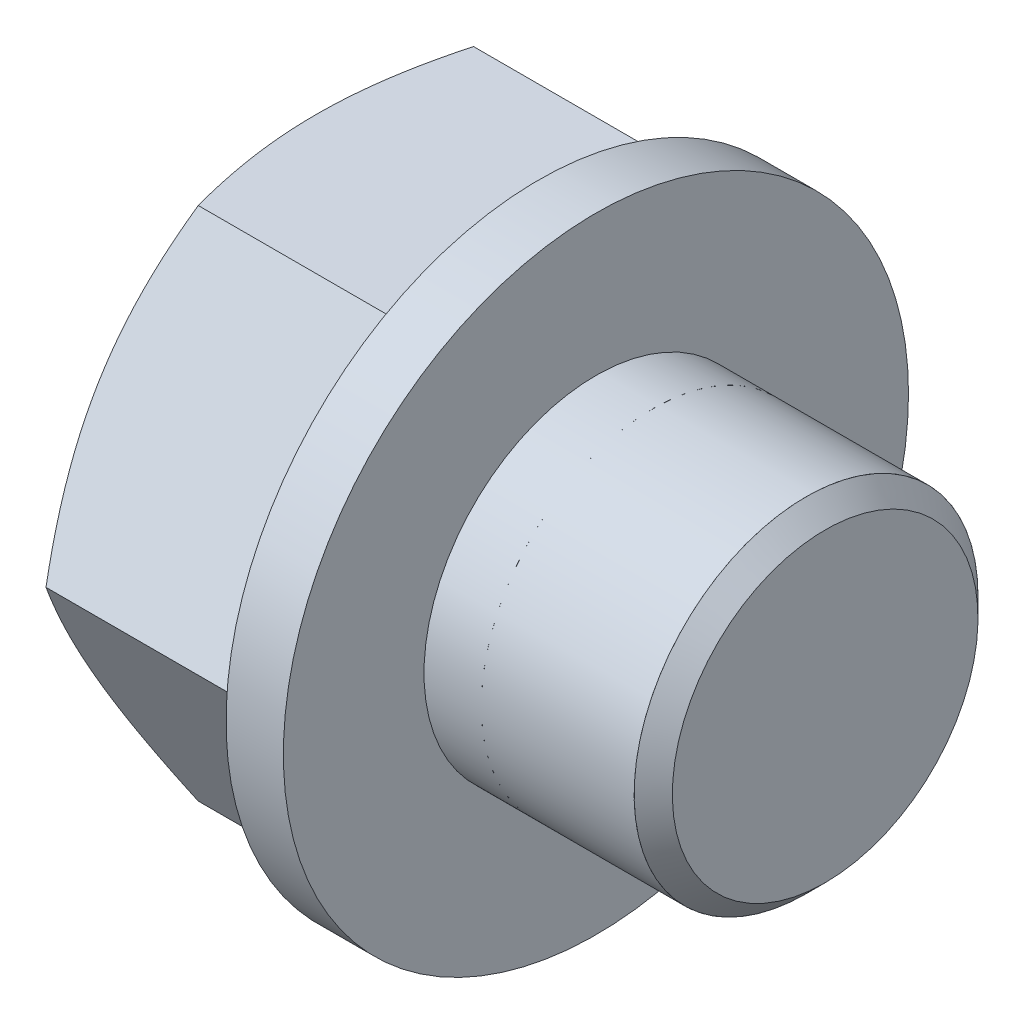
ISO-10303-21;
HEADER;
FILE_DESCRIPTION(('STEP AP214'),'2;1');
FILE_NAME('part.step','',(''),(''),'','','');
FILE_SCHEMA(('AUTOMOTIVE_DESIGN { 1 0 10303 214 1 1 1 1 }'));
ENDSEC;
DATA;
#1=APPLICATION_CONTEXT('core data for automotive mechanical design processes');
#2=APPLICATION_PROTOCOL_DEFINITION('international standard','automotive_design',2000,#1);
#3=PRODUCT_CONTEXT('',#1,'mechanical');
#4=PRODUCT('Part','Part','',(#3));
#5=PRODUCT_RELATED_PRODUCT_CATEGORY('part','',(#4));
#6=PRODUCT_DEFINITION_FORMATION('','',#4);
#7=PRODUCT_DEFINITION_CONTEXT('part definition',#1,'design');
#8=PRODUCT_DEFINITION('design','',#6,#7);
#9=PRODUCT_DEFINITION_SHAPE('','',#8);
#10=(LENGTH_UNIT() NAMED_UNIT(*) SI_UNIT(.MILLI.,.METRE.));
#11=(NAMED_UNIT(*) PLANE_ANGLE_UNIT() SI_UNIT($,.RADIAN.));
#12=(NAMED_UNIT(*) SI_UNIT($,.STERADIAN.) SOLID_ANGLE_UNIT());
#13=UNCERTAINTY_MEASURE_WITH_UNIT(LENGTH_MEASURE(1.E-05),#10,'distance_accuracy_value','');
#14=(GEOMETRIC_REPRESENTATION_CONTEXT(3) GLOBAL_UNCERTAINTY_ASSIGNED_CONTEXT((#13)) GLOBAL_UNIT_ASSIGNED_CONTEXT((#10,
#11,#12)) REPRESENTATION_CONTEXT('',''));
#15=CARTESIAN_POINT('',(0.,0.,0.));
#16=DIRECTION('',(0.,0.,1.));
#17=DIRECTION('',(1.,0.,0.));
#18=AXIS2_PLACEMENT_3D('',#15,#16,#17);
#19=CARTESIAN_POINT('',(14.,0.,0.));
#20=DIRECTION('',(-1.,0.,0.));
#21=DIRECTION('',(0.,0.,1.));
#22=AXIS2_PLACEMENT_3D('',#19,#20,#21);
#23=CYLINDRICAL_SURFACE('',#22,8.);
#24=CARTESIAN_POINT('',(6.,0.,0.));
#25=DIRECTION('',(-1.,0.,0.));
#26=DIRECTION('',(0.,0.,1.));
#27=AXIS2_PLACEMENT_3D('',#24,#25,#26);
#28=CIRCLE('',#27,8.);
#29=CARTESIAN_POINT('',(6.,0.,8.));
#30=VERTEX_POINT('',#29);
#31=EDGE_CURVE('P0_E20',#30,#30,#28,.F.);
#32=ORIENTED_EDGE('',*,*,#31,.T.);
#33=EDGE_LOOP('',(#32));
#34=FACE_BOUND('',#33,.T.);
#35=CARTESIAN_POINT('',(14.,0.,0.));
#36=DIRECTION('',(-1.,0.,0.));
#37=DIRECTION('',(0.,0.,1.));
#38=AXIS2_PLACEMENT_3D('',#35,#36,#37);
#39=CIRCLE('',#38,8.);
#40=CARTESIAN_POINT('',(14.,0.,8.));
#41=VERTEX_POINT('',#40);
#42=EDGE_CURVE('P0_E11',#41,#41,#39,.T.);
#43=ORIENTED_EDGE('',*,*,#42,.T.);
#44=EDGE_LOOP('',(#43));
#45=FACE_BOUND('',#44,.T.);
#46=ADVANCED_FACE('P0_F16',(#34,#45),#23,.T.);
#47=CARTESIAN_POINT('',(14.,0.,0.));
#48=DIRECTION('',(1.,0.,0.));
#49=DIRECTION('',(0.,0.,-1.));
#50=AXIS2_PLACEMENT_3D('',#47,#48,#49);
#51=PLANE('',#50);
#52=ORIENTED_EDGE('',*,*,#42,.F.);
#53=EDGE_LOOP('',(#52));
#54=FACE_BOUND('',#53,.T.);
#55=CARTESIAN_POINT('',(14.,9.,0.));
#56=CARTESIAN_POINT('',(14.,8.99990265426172,0.825985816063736));
#57=CARTESIAN_POINT('',(14.,8.84974831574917,1.63766747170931));
#58=CARTESIAN_POINT('',(14.,8.6905594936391,2.49818637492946));
#59=CARTESIAN_POINT('',(14.,8.36809470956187,3.31285238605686));
#60=CARTESIAN_POINT('',(14.,8.03248230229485,4.1607341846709));
#61=CARTESIAN_POINT('',(14.,7.53295960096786,4.92488778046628));
#62=CARTESIAN_POINT('',(14.,7.02331003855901,5.70453311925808));
#63=CARTESIAN_POINT('',(14.,6.36396103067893,6.36396103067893));
#64=CARTESIAN_POINT('',(14.,5.70536941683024,7.02263145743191));
#65=CARTESIAN_POINT('',(14.,4.92488778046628,7.53295960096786));
#66=CARTESIAN_POINT('',(14.,4.16167124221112,8.03199873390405));
#67=CARTESIAN_POINT('',(14.,3.31285238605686,8.36809470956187));
#68=CARTESIAN_POINT('',(14.,2.4991952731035,8.69026813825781));
#69=CARTESIAN_POINT('',(14.,1.63766747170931,8.84974831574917));
#70=CARTESIAN_POINT('',(14.,0.826255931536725,8.99995131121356));
#71=CARTESIAN_POINT('',(14.,0.,9.));
#72=CARTESIAN_POINT('',(14.,-0.825196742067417,9.00004862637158));
#73=CARTESIAN_POINT('',(14.,-1.6376674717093,8.84974831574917));
#74=CARTESIAN_POINT('',(14.,-2.49818637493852,8.69055949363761));
#75=CARTESIAN_POINT('',(14.,-3.31285238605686,8.36809470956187));
#76=CARTESIAN_POINT('',(14.,-4.16073418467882,8.03248230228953));
#77=CARTESIAN_POINT('',(14.,-4.92488778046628,7.53295960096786));
#78=CARTESIAN_POINT('',(14.,-5.70453311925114,7.02331003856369));
#79=CARTESIAN_POINT('',(14.,-6.36396103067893,6.36396103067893));
#80=CARTESIAN_POINT('',(14.,-7.02263145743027,5.70536941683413));
#81=CARTESIAN_POINT('',(14.,-7.53295960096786,4.92488778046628));
#82=CARTESIAN_POINT('',(14.,-8.03199873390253,4.1616712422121));
#83=CARTESIAN_POINT('',(14.,-8.36809470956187,3.31285238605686));
#84=CARTESIAN_POINT('',(14.,-8.69026813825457,2.49919527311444));
#85=CARTESIAN_POINT('',(14.,-8.84974831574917,1.63766747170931));
#86=CARTESIAN_POINT('',(14.,-8.99990259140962,0.826519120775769));
#87=CARTESIAN_POINT('',(14.,-9.,0.));
#88=B_SPLINE_CURVE_WITH_KNOTS('',2,(#55,#56,#57,#58,#59,#60,#61,#62,#63,#64,#65,#66,#67,#68,#69,
#70,#71,#72,#73,#74,#75,#76,#77,#78,#79,#80,#81,#82,#83,#84,#85,#86,#87),.UNSPECIFIED.,.F.,.F.,
(3,2,2,2,2,2,2,2,2,2,2,2,2,2,2,2,3),(0.,0.0625,0.125,0.1875,0.25,0.3125,0.375,0.4375,0.5,0.5625,
0.625,0.6875,0.75,0.8125,0.875,0.9375,1.),.UNSPECIFIED.);
#89=CARTESIAN_POINT('',(14.,9.,0.));
#90=VERTEX_POINT('',#89);
#91=CARTESIAN_POINT('',(14.,-9.,0.));
#92=VERTEX_POINT('',#91);
#93=EDGE_CURVE('P0_E29',#90,#92,#88,.T.);
#94=ORIENTED_EDGE('',*,*,#93,.F.);
#95=CARTESIAN_POINT('',(14.,-9.,0.));
#96=CARTESIAN_POINT('',(14.,-8.99990265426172,-0.825985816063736));
#97=CARTESIAN_POINT('',(14.,-8.84974831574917,-1.63766747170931));
#98=CARTESIAN_POINT('',(14.,-8.6905594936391,-2.49818637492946));
#99=CARTESIAN_POINT('',(14.,-8.36809470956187,-3.31285238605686));
#100=CARTESIAN_POINT('',(14.,-8.03248230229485,-4.1607341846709));
#101=CARTESIAN_POINT('',(14.,-7.53295960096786,-4.92488778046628));
#102=CARTESIAN_POINT('',(14.,-7.02331003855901,-5.70453311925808));
#103=CARTESIAN_POINT('',(14.,-6.36396103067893,-6.36396103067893));
#104=CARTESIAN_POINT('',(14.,-5.70536941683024,-7.02263145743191));
#105=CARTESIAN_POINT('',(14.,-4.92488778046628,-7.53295960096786));
#106=CARTESIAN_POINT('',(14.,-4.16167124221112,-8.03199873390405));
#107=CARTESIAN_POINT('',(14.,-3.31285238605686,-8.36809470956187));
#108=CARTESIAN_POINT('',(14.,-2.4991952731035,-8.69026813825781));
#109=CARTESIAN_POINT('',(14.,-1.63766747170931,-8.84974831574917));
#110=CARTESIAN_POINT('',(14.,-0.826255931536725,-8.99995131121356));
#111=CARTESIAN_POINT('',(14.,0.,-9.));
#112=CARTESIAN_POINT('',(14.,0.825196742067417,-9.00004862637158));
#113=CARTESIAN_POINT('',(14.,1.6376674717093,-8.84974831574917));
#114=CARTESIAN_POINT('',(14.,2.49818637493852,-8.69055949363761));
#115=CARTESIAN_POINT('',(14.,3.31285238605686,-8.36809470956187));
#116=CARTESIAN_POINT('',(14.,4.16073418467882,-8.03248230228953));
#117=CARTESIAN_POINT('',(14.,4.92488778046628,-7.53295960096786));
#118=CARTESIAN_POINT('',(14.,5.70453311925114,-7.02331003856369));
#119=CARTESIAN_POINT('',(14.,6.36396103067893,-6.36396103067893));
#120=CARTESIAN_POINT('',(14.,7.02263145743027,-5.70536941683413));
#121=CARTESIAN_POINT('',(14.,7.53295960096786,-4.92488778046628));
#122=CARTESIAN_POINT('',(14.,8.03199873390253,-4.1616712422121));
#123=CARTESIAN_POINT('',(14.,8.36809470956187,-3.31285238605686));
#124=CARTESIAN_POINT('',(14.,8.69026813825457,-2.49919527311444));
#125=CARTESIAN_POINT('',(14.,8.84974831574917,-1.63766747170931));
#126=CARTESIAN_POINT('',(14.,8.99990259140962,-0.826519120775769));
#127=CARTESIAN_POINT('',(14.,9.,0.));
#128=B_SPLINE_CURVE_WITH_KNOTS('',2,(#95,#96,#97,#98,#99,#100,#101,#102,#103,#104,#105,#106,
#107,#108,#109,#110,#111,#112,#113,#114,#115,#116,#117,#118,#119,#120,#121,#122,#123,#124,#125,
#126,#127),.UNSPECIFIED.,.F.,.F.,(3,2,2,2,2,2,2,2,2,2,2,2,2,2,2,2,3),(0.,0.0625,0.125,0.1875,
0.25,0.3125,0.375,0.4375,0.5,0.5625,0.625,0.6875,0.75,0.8125,0.875,0.9375,1.),.UNSPECIFIED.);
#129=EDGE_CURVE('P0_E48',#92,#90,#128,.T.);
#130=ORIENTED_EDGE('',*,*,#129,.F.);
#131=EDGE_LOOP('',(#94,#130));
#132=FACE_BOUND('',#131,.T.);
#133=ADVANCED_FACE('P0_F67',(#54,#132),#51,.F.);
#134=CARTESIAN_POINT('',(6.,0.,0.));
#135=DIRECTION('',(1.,0.,0.));
#136=DIRECTION('',(0.,0.,-1.));
#137=AXIS2_PLACEMENT_3D('',#134,#135,#136);
#138=PLANE('',#137);
#139=ORIENTED_EDGE('',*,*,#31,.F.);
#140=EDGE_LOOP('',(#139));
#141=FACE_BOUND('',#140,.T.);
#142=CARTESIAN_POINT('',(6.,-9.,0.));
#143=CARTESIAN_POINT('',(6.,-8.99990265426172,-0.825985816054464));
#144=CARTESIAN_POINT('',(6.,-8.84974831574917,-1.63766747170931));
#145=CARTESIAN_POINT('',(6.,-8.69055949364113,-2.4981863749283));
#146=CARTESIAN_POINT('',(6.,-8.36809470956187,-3.31285238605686));
#147=CARTESIAN_POINT('',(6.,-8.03248230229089,-4.16073418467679));
#148=CARTESIAN_POINT('',(6.,-7.53295960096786,-4.92488778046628));
#149=CARTESIAN_POINT('',(6.,-7.0233100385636,-5.70453311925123));
#150=CARTESIAN_POINT('',(6.,-6.36396103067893,-6.36396103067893));
#151=CARTESIAN_POINT('',(6.,-5.70536941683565,-7.02263145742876));
#152=CARTESIAN_POINT('',(6.,-4.92488778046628,-7.53295960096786));
#153=CARTESIAN_POINT('',(6.,-4.16167124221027,-8.03199873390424));
#154=CARTESIAN_POINT('',(6.,-3.31285238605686,-8.36809470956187));
#155=CARTESIAN_POINT('',(6.,-2.49919527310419,-8.69026813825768));
#156=CARTESIAN_POINT('',(6.,-1.6376674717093,-8.84974831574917));
#157=CARTESIAN_POINT('',(6.,-0.826255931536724,-8.99995131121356));
#158=CARTESIAN_POINT('',(6.,0.,-9.));
#159=CARTESIAN_POINT('',(6.,0.825196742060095,-9.00004862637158));
#160=CARTESIAN_POINT('',(6.,1.63766747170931,-8.84974831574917));
#161=CARTESIAN_POINT('',(6.,2.49818637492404,-8.69055949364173));
#162=CARTESIAN_POINT('',(6.,3.31285238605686,-8.36809470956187));
#163=CARTESIAN_POINT('',(6.,4.16073418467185,-8.03248230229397));
#164=CARTESIAN_POINT('',(6.,4.92488778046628,-7.53295960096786));
#165=CARTESIAN_POINT('',(6.,5.70453311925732,-7.02331003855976));
#166=CARTESIAN_POINT('',(6.,6.36396103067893,-6.36396103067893));
#167=CARTESIAN_POINT('',(6.,7.02263145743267,-5.70536941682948));
#168=CARTESIAN_POINT('',(6.,7.53295960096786,-4.92488778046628));
#169=CARTESIAN_POINT('',(6.,8.0319987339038,-4.16167124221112));
#170=CARTESIAN_POINT('',(6.,8.36809470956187,-3.31285238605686));
#171=CARTESIAN_POINT('',(6.,8.6902681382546,-2.49919527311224));
#172=CARTESIAN_POINT('',(6.,8.84974831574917,-1.63766747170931));
#173=CARTESIAN_POINT('',(6.,8.99990259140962,-0.826519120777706));
#174=CARTESIAN_POINT('',(6.,9.,0.));
#175=B_SPLINE_CURVE_WITH_KNOTS('',2,(#142,#143,#144,#145,#146,#147,#148,#149,#150,#151,#152,
#153,#154,#155,#156,#157,#158,#159,#160,#161,#162,#163,#164,#165,#166,#167,#168,#169,#170,#171,
#172,#173,#174),.UNSPECIFIED.,.F.,.F.,(3,2,2,2,2,2,2,2,2,2,2,2,2,2,2,2,3),(0.,0.0625,0.125,
0.1875,0.25,0.3125,0.375,0.4375,0.5,0.5625,0.625,0.6875,0.75,0.8125,0.875,0.9375,1.),.UNSPECIFIED.);
#176=CARTESIAN_POINT('',(6.,-9.,0.));
#177=VERTEX_POINT('',#176);
#178=CARTESIAN_POINT('',(6.,9.,0.));
#179=VERTEX_POINT('',#178);
#180=EDGE_CURVE('P0_E35',#177,#179,#175,.T.);
#181=ORIENTED_EDGE('',*,*,#180,.T.);
#182=CARTESIAN_POINT('',(6.,9.,0.));
#183=CARTESIAN_POINT('',(6.,8.99990265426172,0.825985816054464));
#184=CARTESIAN_POINT('',(6.,8.84974831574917,1.63766747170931));
#185=CARTESIAN_POINT('',(6.,8.69055949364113,2.4981863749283));
#186=CARTESIAN_POINT('',(6.,8.36809470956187,3.31285238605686));
#187=CARTESIAN_POINT('',(6.,8.03248230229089,4.16073418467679));
#188=CARTESIAN_POINT('',(6.,7.53295960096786,4.92488778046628));
#189=CARTESIAN_POINT('',(6.,7.0233100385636,5.70453311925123));
#190=CARTESIAN_POINT('',(6.,6.36396103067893,6.36396103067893));
#191=CARTESIAN_POINT('',(6.,5.70536941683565,7.02263145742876));
#192=CARTESIAN_POINT('',(6.,4.92488778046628,7.53295960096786));
#193=CARTESIAN_POINT('',(6.,4.16167124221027,8.03199873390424));
#194=CARTESIAN_POINT('',(6.,3.31285238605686,8.36809470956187));
#195=CARTESIAN_POINT('',(6.,2.49919527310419,8.69026813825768));
#196=CARTESIAN_POINT('',(6.,1.6376674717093,8.84974831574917));
#197=CARTESIAN_POINT('',(6.,0.826255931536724,8.99995131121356));
#198=CARTESIAN_POINT('',(6.,0.,9.));
#199=CARTESIAN_POINT('',(6.,-0.825196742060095,9.00004862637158));
#200=CARTESIAN_POINT('',(6.,-1.63766747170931,8.84974831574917));
#201=CARTESIAN_POINT('',(6.,-2.49818637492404,8.69055949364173));
#202=CARTESIAN_POINT('',(6.,-3.31285238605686,8.36809470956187));
#203=CARTESIAN_POINT('',(6.,-4.16073418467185,8.03248230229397));
#204=CARTESIAN_POINT('',(6.,-4.92488778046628,7.53295960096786));
#205=CARTESIAN_POINT('',(6.,-5.70453311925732,7.02331003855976));
#206=CARTESIAN_POINT('',(6.,-6.36396103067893,6.36396103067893));
#207=CARTESIAN_POINT('',(6.,-7.02263145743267,5.70536941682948));
#208=CARTESIAN_POINT('',(6.,-7.53295960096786,4.92488778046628));
#209=CARTESIAN_POINT('',(6.,-8.0319987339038,4.16167124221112));
#210=CARTESIAN_POINT('',(6.,-8.36809470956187,3.31285238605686));
#211=CARTESIAN_POINT('',(6.,-8.6902681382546,2.49919527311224));
#212=CARTESIAN_POINT('',(6.,-8.84974831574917,1.63766747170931));
#213=CARTESIAN_POINT('',(6.,-8.99990259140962,0.826519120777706));
#214=CARTESIAN_POINT('',(6.,-9.,0.));
#215=B_SPLINE_CURVE_WITH_KNOTS('',2,(#182,#183,#184,#185,#186,#187,#188,#189,#190,#191,#192,
#193,#194,#195,#196,#197,#198,#199,#200,#201,#202,#203,#204,#205,#206,#207,#208,#209,#210,#211,
#212,#213,#214),.UNSPECIFIED.,.F.,.F.,(3,2,2,2,2,2,2,2,2,2,2,2,2,2,2,2,3),(0.,0.0625,0.125,
0.1875,0.25,0.3125,0.375,0.4375,0.5,0.5625,0.625,0.6875,0.75,0.8125,0.875,0.9375,1.),.UNSPECIFIED.);
#216=EDGE_CURVE('P0_E39',#179,#177,#215,.T.);
#217=ORIENTED_EDGE('',*,*,#216,.T.);
#218=EDGE_LOOP('',(#181,#217));
#219=FACE_BOUND('',#218,.T.);
#220=ADVANCED_FACE('P0_F17',(#141,#219),#138,.T.);
#221=OPEN_SHELL('',(#46,#133,#220));
#222=SHELL_BASED_SURFACE_MODEL('P0_B1',(#221));
#223=CARTESIAN_POINT('',(-12.,0.,0.));
#224=DIRECTION('',(-1.,0.,0.));
#225=DIRECTION('',(0.,0.,1.));
#226=AXIS2_PLACEMENT_3D('',#223,#224,#225);
#227=PLANE('',#226);
#228=CARTESIAN_POINT('',(-11.9999999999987,0.,0.));
#229=DIRECTION('',(1.,0.,0.));
#230=DIRECTION('',(0.,0.,-1.));
#231=AXIS2_PLACEMENT_3D('',#228,#229,#230);
#232=CIRCLE('',#231,12.8999999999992);
#233=CARTESIAN_POINT('',(-11.9999999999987,0.,-12.8999999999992));
#234=VERTEX_POINT('',#233);
#235=EDGE_CURVE('P1_E19',#234,#234,#232,.T.);
#236=ORIENTED_EDGE('',*,*,#235,.F.);
#237=EDGE_LOOP('',(#236));
#238=FACE_BOUND('',#237,.T.);
#239=ADVANCED_FACE('P1_F16',(#238),#227,.T.);
#240=CARTESIAN_POINT('',(-10.6044675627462,0.,0.));
#241=DIRECTION('',(1.,0.,0.));
#242=DIRECTION('',(0.,0.,-1.));
#243=AXIS2_PLACEMENT_3D('',#240,#241,#242);
#244=CONICAL_SURFACE('',#243,15.3171330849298,1.0471975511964);
#245=ORIENTED_EDGE('',*,*,#235,.T.);
#246=EDGE_LOOP('',(#245));
#247=FACE_BOUND('',#246,.T.);
#248=CARTESIAN_POINT('',(-10.612790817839,-13.5,7.20577136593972));
#249=CARTESIAN_POINT('',(-10.6933291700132,-13.5,6.90949405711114));
#250=CARTESIAN_POINT('',(-10.7702782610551,-13.5,6.61225443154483));
#251=CARTESIAN_POINT('',(-10.9161877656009,-13.5,6.01575773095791));
#252=CARTESIAN_POINT('',(-10.9851464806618,-13.5,5.71650024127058));
#253=CARTESIAN_POINT('',(-11.1789651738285,-13.5,4.81485255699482));
#254=CARTESIAN_POINT('',(-11.2905216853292,-13.5,4.20947362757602));
#255=CARTESIAN_POINT('',(-11.4254238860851,-13.5,3.30296628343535));
#256=CARTESIAN_POINT('',(-11.4647394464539,-13.5,3.00415120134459));
#257=CARTESIAN_POINT('',(-11.5326553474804,-13.5,2.4053136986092));
#258=CARTESIAN_POINT('',(-11.5612566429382,-13.5,2.10529138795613));
#259=CARTESIAN_POINT('',(-11.607212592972,-13.5,1.50461339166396));
#260=CARTESIAN_POINT('',(-11.6245757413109,-13.5,1.20395835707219));
#261=CARTESIAN_POINT('',(-11.64776432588,-13.5,0.60220221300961));
#262=CARTESIAN_POINT('',(-11.6535898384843,-13.5,0.301101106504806));
#263=CARTESIAN_POINT('',(-11.6535898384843,-13.5,-0.3011011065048));
#264=CARTESIAN_POINT('',(-11.64776432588,-13.5,-0.602202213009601));
#265=CARTESIAN_POINT('',(-11.6245757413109,-13.5,-1.20395835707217));
#266=CARTESIAN_POINT('',(-11.607212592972,-13.5,-1.50461339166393));
#267=CARTESIAN_POINT('',(-11.5612566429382,-13.5,-2.1052913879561));
#268=CARTESIAN_POINT('',(-11.5326553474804,-13.5,-2.40531369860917));
#269=CARTESIAN_POINT('',(-11.4647394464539,-13.5,-3.00415120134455));
#270=CARTESIAN_POINT('',(-11.4254238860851,-13.5,-3.3029662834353));
#271=CARTESIAN_POINT('',(-11.2905216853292,-13.5,-4.20947362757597));
#272=CARTESIAN_POINT('',(-11.1789651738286,-13.5,-4.81485255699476));
#273=CARTESIAN_POINT('',(-10.9851464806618,-13.5,-5.71650024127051));
#274=CARTESIAN_POINT('',(-10.9161877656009,-13.5,-6.01575773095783));
#275=CARTESIAN_POINT('',(-10.7702782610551,-13.5,-6.61225443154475));
#276=CARTESIAN_POINT('',(-10.6933291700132,-13.5,-6.90949405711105));
#277=CARTESIAN_POINT('',(-10.612790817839,-13.5,-7.20577136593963));
#278=B_SPLINE_CURVE_WITH_KNOTS('',3,(#248,#249,#250,#251,#252,#253,#254,#255,#256,#257,#258,
#259,#260,#261,#262,#263,#264,#265,#266,#267,#268,#269,#270,#271,#272,#273,#274,#275,#276,#277),
.UNSPECIFIED.,.F.,.F.,(4,2,2,2,2,2,2,2,2,2,2,2,2,2,4),(0.,0.921026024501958,1.84224746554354,
3.68744669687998,4.59146453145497,5.49540178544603,6.39865504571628,7.30190232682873,
8.20514960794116,9.1084028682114,10.0123401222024,10.9163579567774,12.7615571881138,
13.6827786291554,14.6038046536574),.UNSPECIFIED.);
#279=CARTESIAN_POINT('',(-10.6127908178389,-13.5,7.20577136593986));
#280=VERTEX_POINT('',#279);
#281=CARTESIAN_POINT('',(-10.612790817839,-13.4999999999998,-7.20577136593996));
#282=VERTEX_POINT('',#281);
#283=EDGE_CURVE('P1_E84',#280,#282,#278,.T.);
#284=ORIENTED_EDGE('',*,*,#283,.F.);
#285=CARTESIAN_POINT('',(-10.7875644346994,-2.78345438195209E-13,15.));
#286=CARTESIAN_POINT('',(-10.8827562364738,-0.285599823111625,14.8351088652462));
#287=CARTESIAN_POINT('',(-10.9736270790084,-0.572313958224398,14.6695743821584));
#288=CARTESIAN_POINT('',(-11.1455253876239,-1.14804177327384,14.3371777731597));
#289=CARTESIAN_POINT('',(-11.2265496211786,-1.43705617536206,14.1703152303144));
#290=CARTESIAN_POINT('',(-11.3776680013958,-2.0179552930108,13.8349329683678));
#291=CARTESIAN_POINT('',(-11.4477358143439,-2.30984518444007,13.6664102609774));
#292=CARTESIAN_POINT('',(-11.5754317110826,-2.89565357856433,13.3281936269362));
#293=CARTESIAN_POINT('',(-11.6330605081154,-3.18957196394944,13.1584997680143));
#294=CARTESIAN_POINT('',(-11.7333969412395,-3.77173468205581,12.8223879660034));
#295=CARTESIAN_POINT('',(-11.776444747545,-4.05993477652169,12.6559955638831));
#296=CARTESIAN_POINT('',(-11.8486240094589,-4.63765362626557,12.3224494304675));
#297=CARTESIAN_POINT('',(-11.8777552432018,-4.92717240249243,12.1552956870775));
#298=CARTESIAN_POINT('',(-11.9213653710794,-5.50668519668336,11.8207138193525));
#299=CARTESIAN_POINT('',(-11.9358622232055,-5.79667819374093,11.6532862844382));
#300=CARTESIAN_POINT('',(-11.9498948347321,-6.37693361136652,11.3182756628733));
#301=CARTESIAN_POINT('',(-11.9494308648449,-6.66719602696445,11.1506925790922));
#302=CARTESIAN_POINT('',(-11.9339931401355,-7.23145847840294,10.8249155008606));
#303=CARTESIAN_POINT('',(-11.9198184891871,-7.50547526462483,10.6667118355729));
#304=CARTESIAN_POINT('',(-11.8784470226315,-8.05276568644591,10.3507335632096));
#305=CARTESIAN_POINT('',(-11.8512502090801,-8.32603932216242,10.1929589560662));
#306=CARTESIAN_POINT('',(-11.7843854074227,-8.87173895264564,9.87789912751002));
#307=CARTESIAN_POINT('',(-11.7447037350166,-9.14416368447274,9.72061463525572));
#308=CARTESIAN_POINT('',(-11.6536764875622,-9.68755055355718,9.4068900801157));
#309=CARTESIAN_POINT('',(-11.6023299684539,-9.95851257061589,9.25045008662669));
#310=CARTESIAN_POINT('',(-11.4293741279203,-10.7821602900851,8.77491685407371));
#311=CARTESIAN_POINT('',(-11.2905634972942,-11.3321872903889,8.4573586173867));
#312=CARTESIAN_POINT('',(-11.0551292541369,-12.150432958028,7.98494426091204));
#313=CARTESIAN_POINT('',(-10.9722261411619,-12.4217397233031,7.82830522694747));
#314=CARTESIAN_POINT('',(-10.7983314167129,-12.9623403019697,7.51618933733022));
#315=CARTESIAN_POINT('',(-10.7073416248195,-13.2316345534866,7.36071222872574));
#316=CARTESIAN_POINT('',(-10.612790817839,-13.4999999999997,7.20577136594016));
#317=B_SPLINE_CURVE_WITH_KNOTS('',3,(#285,#286,#287,#288,#289,#290,#291,#292,#293,#294,#295,
#296,#297,#298,#299,#300,#301,#302,#303,#304,#305,#306,#307,#308,#309,#310,#311,#312,#313,#314,
#315,#316),.UNSPECIFIED.,.F.,.F.,(4,2,2,2,2,2,2,2,2,2,2,2,2,2,2,4),(0.,1.02976500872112,
2.05986716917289,3.09240833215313,4.12489027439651,5.13128890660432,6.13770358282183,
7.14288177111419,8.14804177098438,9.09794129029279,10.0478406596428,10.998784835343,
11.9498060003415,13.8985146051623,14.8706268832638,15.8425209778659),.UNSPECIFIED.);
#318=CARTESIAN_POINT('',(-10.7875644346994,-1.39133136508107E-13,15.));
#319=VERTEX_POINT('',#318);
#320=EDGE_CURVE('P1_E115',#319,#280,#317,.T.);
#321=ORIENTED_EDGE('',*,*,#320,.F.);
#322=CARTESIAN_POINT('',(-10.6127908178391,13.4999999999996,7.20577136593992));
#323=CARTESIAN_POINT('',(-10.8169734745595,12.9205261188,7.54033076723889));
#324=CARTESIAN_POINT('',(-11.0047629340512,12.3359608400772,7.87782968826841));
#325=CARTESIAN_POINT('',(-11.3374597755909,11.156083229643,8.55903234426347));
#326=CARTESIAN_POINT('',(-11.4822439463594,10.5607451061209,8.90275097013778));
#327=CARTESIAN_POINT('',(-11.6572091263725,9.6694640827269,9.41733230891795));
#328=CARTESIAN_POINT('',(-11.7080821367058,9.37657583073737,9.5864314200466));
#329=CARTESIAN_POINT('',(-11.7958562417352,8.78921494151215,9.92554438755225));
#330=CARTESIAN_POINT('',(-11.8327571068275,8.49474227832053,10.0955582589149));
#331=CARTESIAN_POINT('',(-11.8916464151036,7.90507103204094,10.4360051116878));
#332=CARTESIAN_POINT('',(-11.9136547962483,7.60987395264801,10.6064372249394));
#333=CARTESIAN_POINT('',(-11.9422657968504,7.01892185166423,10.9476235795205));
#334=CARTESIAN_POINT('',(-11.9488688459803,6.72316684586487,11.118377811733));
#335=CARTESIAN_POINT('',(-11.9466046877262,6.1587823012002,11.4442253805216));
#336=CARTESIAN_POINT('',(-11.9390982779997,5.89014796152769,11.5993214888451));
#337=CARTESIAN_POINT('',(-11.9113989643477,5.35337462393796,11.9092277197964));
#338=CARTESIAN_POINT('',(-11.8912061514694,5.08523562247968,12.0640378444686));
#339=CARTESIAN_POINT('',(-11.8385355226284,4.54957488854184,12.3733017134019));
#340=CARTESIAN_POINT('',(-11.8060444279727,4.28205413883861,12.5277548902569));
#341=CARTESIAN_POINT('',(-11.7294417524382,3.74828448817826,12.8359269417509));
#342=CARTESIAN_POINT('',(-11.6853302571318,3.48203557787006,12.9896458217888));
#343=CARTESIAN_POINT('',(-11.5343655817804,2.67276639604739,13.456877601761));
#344=CARTESIAN_POINT('',(-11.4102068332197,2.13211089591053,13.7690252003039));
#345=CARTESIAN_POINT('',(-11.1960356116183,1.32751920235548,14.2335564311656));
#346=CARTESIAN_POINT('',(-11.120078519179,1.06064787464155,14.3876346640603));
#347=CARTESIAN_POINT('',(-10.9598325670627,0.52888095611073,14.6946504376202));
#348=CARTESIAN_POINT('',(-10.8755465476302,0.263984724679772,14.8475883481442));
#349=CARTESIAN_POINT('',(-10.7875644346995,0.,15.));
#350=B_SPLINE_CURVE_WITH_KNOTS('',3,(#322,#323,#324,#325,#326,#327,#328,#329,#330,#331,#332,
#333,#334,#335,#336,#337,#338,#339,#340,#341,#342,#343,#344,#345,#346,#347,#348,#349),
.UNSPECIFIED.,.F.,.F.,(4,2,2,2,2,2,2,2,2,2,2,2,2,4),(0.,2.09987332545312,4.2057060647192,
5.23145045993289,6.25721171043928,7.28159694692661,8.30595361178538,9.2365420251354,
10.1671237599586,11.0987131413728,12.0302956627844,13.9381730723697,14.8902314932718,
15.841966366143),.UNSPECIFIED.);
#351=CARTESIAN_POINT('',(-10.612790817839,13.4999999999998,7.20577136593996));
#352=VERTEX_POINT('',#351);
#353=EDGE_CURVE('P1_E136',#352,#319,#350,.T.);
#354=ORIENTED_EDGE('',*,*,#353,.F.);
#355=CARTESIAN_POINT('',(-10.612790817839,13.5,-7.20577136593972));
#356=CARTESIAN_POINT('',(-10.6933291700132,13.5,-6.90949405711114));
#357=CARTESIAN_POINT('',(-10.7702782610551,13.5,-6.61225443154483));
#358=CARTESIAN_POINT('',(-10.9161877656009,13.5,-6.01575773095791));
#359=CARTESIAN_POINT('',(-10.9851464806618,13.5,-5.71650024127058));
#360=CARTESIAN_POINT('',(-11.1789651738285,13.5,-4.81485255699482));
#361=CARTESIAN_POINT('',(-11.2905216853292,13.5,-4.20947362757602));
#362=CARTESIAN_POINT('',(-11.4254238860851,13.5,-3.30296628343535));
#363=CARTESIAN_POINT('',(-11.4647394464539,13.5,-3.00415120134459));
#364=CARTESIAN_POINT('',(-11.5326553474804,13.5,-2.40531369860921));
#365=CARTESIAN_POINT('',(-11.5612566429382,13.5,-2.10529138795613));
#366=CARTESIAN_POINT('',(-11.607212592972,13.5,-1.50461339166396));
#367=CARTESIAN_POINT('',(-11.6245757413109,13.5,-1.20395835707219));
#368=CARTESIAN_POINT('',(-11.64776432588,13.5,-0.60220221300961));
#369=CARTESIAN_POINT('',(-11.6535898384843,13.5,-0.301101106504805));
#370=CARTESIAN_POINT('',(-11.6535898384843,13.5,0.301101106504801));
#371=CARTESIAN_POINT('',(-11.64776432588,13.5,0.602202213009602));
#372=CARTESIAN_POINT('',(-11.6245757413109,13.5,1.20395835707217));
#373=CARTESIAN_POINT('',(-11.607212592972,13.5,1.50461339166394));
#374=CARTESIAN_POINT('',(-11.5612566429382,13.5,2.1052913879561));
#375=CARTESIAN_POINT('',(-11.5326553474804,13.5,2.40531369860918));
#376=CARTESIAN_POINT('',(-11.4647394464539,13.5,3.00415120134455));
#377=CARTESIAN_POINT('',(-11.4254238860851,13.5,3.30296628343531));
#378=CARTESIAN_POINT('',(-11.2905216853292,13.5,4.20947362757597));
#379=CARTESIAN_POINT('',(-11.1789651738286,13.5,4.81485255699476));
#380=CARTESIAN_POINT('',(-10.9851464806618,13.5,5.71650024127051));
#381=CARTESIAN_POINT('',(-10.9161877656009,13.5,6.01575773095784));
#382=CARTESIAN_POINT('',(-10.7702782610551,13.5,6.61225443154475));
#383=CARTESIAN_POINT('',(-10.6933291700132,13.5,6.90949405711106));
#384=CARTESIAN_POINT('',(-10.612790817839,13.5,7.20577136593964));
#385=B_SPLINE_CURVE_WITH_KNOTS('',3,(#355,#356,#357,#358,#359,#360,#361,#362,#363,#364,#365,
#366,#367,#368,#369,#370,#371,#372,#373,#374,#375,#376,#377,#378,#379,#380,#381,#382,#383,#384),
.UNSPECIFIED.,.F.,.F.,(4,2,2,2,2,2,2,2,2,2,2,2,2,2,4),(0.,0.921026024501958,1.84224746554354,
3.68744669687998,4.59146453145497,5.49540178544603,6.39865504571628,7.30190232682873,
8.20514960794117,9.10840286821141,10.0123401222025,10.9163579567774,12.7615571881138,
13.6827786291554,14.6038046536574),.UNSPECIFIED.);
#386=CARTESIAN_POINT('',(-10.612790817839,13.4999999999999,-7.20577136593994));
#387=VERTEX_POINT('',#386);
#388=EDGE_CURVE('P1_E74',#387,#352,#385,.T.);
#389=ORIENTED_EDGE('',*,*,#388,.F.);
#390=CARTESIAN_POINT('',(-10.7875644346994,2.61038769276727E-13,-15.));
#391=CARTESIAN_POINT('',(-10.8827562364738,0.285599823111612,-14.8351088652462));
#392=CARTESIAN_POINT('',(-10.9736270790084,0.572313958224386,-14.6695743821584));
#393=CARTESIAN_POINT('',(-11.1455253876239,1.14804177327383,-14.3371777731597));
#394=CARTESIAN_POINT('',(-11.2265496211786,1.43705617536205,-14.1703152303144));
#395=CARTESIAN_POINT('',(-11.3776680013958,2.01795529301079,-13.8349329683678));
#396=CARTESIAN_POINT('',(-11.4477358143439,2.30984518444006,-13.6664102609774));
#397=CARTESIAN_POINT('',(-11.5754317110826,2.89565357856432,-13.3281936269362));
#398=CARTESIAN_POINT('',(-11.6330605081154,3.18957196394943,-13.1584997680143));
#399=CARTESIAN_POINT('',(-11.7333969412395,3.7717346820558,-12.8223879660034));
#400=CARTESIAN_POINT('',(-11.776444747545,4.05993477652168,-12.6559955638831));
#401=CARTESIAN_POINT('',(-11.8486240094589,4.63765362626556,-12.3224494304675));
#402=CARTESIAN_POINT('',(-11.8777552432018,4.92717240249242,-12.1552956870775));
#403=CARTESIAN_POINT('',(-11.9213653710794,5.50668519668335,-11.8207138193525));
#404=CARTESIAN_POINT('',(-11.9358622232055,5.79667819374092,-11.6532862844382));
#405=CARTESIAN_POINT('',(-11.9498948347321,6.37693361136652,-11.3182756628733));
#406=CARTESIAN_POINT('',(-11.9494308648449,6.66719602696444,-11.1506925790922));
#407=CARTESIAN_POINT('',(-11.9339931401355,7.23145847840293,-10.8249155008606));
#408=CARTESIAN_POINT('',(-11.9198184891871,7.50547526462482,-10.6667118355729));
#409=CARTESIAN_POINT('',(-11.8784470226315,8.05276568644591,-10.3507335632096));
#410=CARTESIAN_POINT('',(-11.8512502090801,8.32603932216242,-10.1929589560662));
#411=CARTESIAN_POINT('',(-11.7843854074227,8.87173895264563,-9.87789912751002));
#412=CARTESIAN_POINT('',(-11.7447037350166,9.14416368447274,-9.72061463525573));
#413=CARTESIAN_POINT('',(-11.6536764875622,9.68755055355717,-9.4068900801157));
#414=CARTESIAN_POINT('',(-11.6023299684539,9.95851257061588,-9.25045008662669));
#415=CARTESIAN_POINT('',(-11.4293741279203,10.7821602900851,-8.77491685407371));
#416=CARTESIAN_POINT('',(-11.2905634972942,11.3321872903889,-8.4573586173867));
#417=CARTESIAN_POINT('',(-11.0551292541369,12.150432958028,-7.98494426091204));
#418=CARTESIAN_POINT('',(-10.9722261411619,12.4217397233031,-7.82830522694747));
#419=CARTESIAN_POINT('',(-10.7983314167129,12.9623403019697,-7.51618933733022));
#420=CARTESIAN_POINT('',(-10.7073416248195,13.2316345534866,-7.36071222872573));
#421=CARTESIAN_POINT('',(-10.612790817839,13.4999999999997,-7.20577136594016));
#422=B_SPLINE_CURVE_WITH_KNOTS('',3,(#390,#391,#392,#393,#394,#395,#396,#397,#398,#399,#400,
#401,#402,#403,#404,#405,#406,#407,#408,#409,#410,#411,#412,#413,#414,#415,#416,#417,#418,#419,
#420,#421),.UNSPECIFIED.,.F.,.F.,(4,2,2,2,2,2,2,2,2,2,2,2,2,2,2,4),(0.,1.02976500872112,
2.05986716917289,3.09240833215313,4.12489027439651,5.13128890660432,6.13770358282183,
7.1428817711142,8.14804177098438,9.0979412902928,10.0478406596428,10.998784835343,
11.9498060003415,13.8985146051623,14.8706268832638,15.8425209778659),.UNSPECIFIED.);
#423=CARTESIAN_POINT('',(-10.7875644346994,1.30184410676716E-13,-15.));
#424=VERTEX_POINT('',#423);
#425=EDGE_CURVE('P1_E67',#424,#387,#422,.T.);
#426=ORIENTED_EDGE('',*,*,#425,.F.);
#427=CARTESIAN_POINT('',(-10.6127908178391,-13.4999999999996,-7.20577136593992));
#428=CARTESIAN_POINT('',(-10.8169734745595,-12.9205261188,-7.54033076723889));
#429=CARTESIAN_POINT('',(-11.0047629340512,-12.3359608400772,-7.87782968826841));
#430=CARTESIAN_POINT('',(-11.3374597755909,-11.156083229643,-8.55903234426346));
#431=CARTESIAN_POINT('',(-11.4822439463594,-10.5607451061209,-8.90275097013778));
#432=CARTESIAN_POINT('',(-11.6572091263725,-9.66946408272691,-9.41733230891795));
#433=CARTESIAN_POINT('',(-11.7080821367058,-9.37657583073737,-9.58643142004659));
#434=CARTESIAN_POINT('',(-11.7958562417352,-8.78921494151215,-9.92554438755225));
#435=CARTESIAN_POINT('',(-11.8327571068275,-8.49474227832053,-10.0955582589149));
#436=CARTESIAN_POINT('',(-11.8916464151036,-7.90507103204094,-10.4360051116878));
#437=CARTESIAN_POINT('',(-11.9136547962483,-7.60987395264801,-10.6064372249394));
#438=CARTESIAN_POINT('',(-11.9422657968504,-7.01892185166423,-10.9476235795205));
#439=CARTESIAN_POINT('',(-11.9488688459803,-6.72316684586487,-11.118377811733));
#440=CARTESIAN_POINT('',(-11.9466046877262,-6.1587823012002,-11.4442253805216));
#441=CARTESIAN_POINT('',(-11.9390982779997,-5.89014796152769,-11.5993214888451));
#442=CARTESIAN_POINT('',(-11.9113989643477,-5.35337462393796,-11.9092277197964));
#443=CARTESIAN_POINT('',(-11.8912061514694,-5.08523562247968,-12.0640378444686));
#444=CARTESIAN_POINT('',(-11.8385355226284,-4.54957488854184,-12.3733017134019));
#445=CARTESIAN_POINT('',(-11.8060444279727,-4.28205413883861,-12.5277548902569));
#446=CARTESIAN_POINT('',(-11.7294417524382,-3.74828448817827,-12.8359269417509));
#447=CARTESIAN_POINT('',(-11.6853302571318,-3.48203557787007,-12.9896458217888));
#448=CARTESIAN_POINT('',(-11.5343655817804,-2.67276639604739,-13.456877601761));
#449=CARTESIAN_POINT('',(-11.4102068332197,-2.13211089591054,-13.7690252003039));
#450=CARTESIAN_POINT('',(-11.1960356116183,-1.32751920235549,-14.2335564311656));
#451=CARTESIAN_POINT('',(-11.120078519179,-1.06064787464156,-14.3876346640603));
#452=CARTESIAN_POINT('',(-10.9598325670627,-0.528880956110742,-14.6946504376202));
#453=CARTESIAN_POINT('',(-10.8755465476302,-0.263984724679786,-14.8475883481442));
#454=CARTESIAN_POINT('',(-10.7875644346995,0.,-15.));
#455=B_SPLINE_CURVE_WITH_KNOTS('',3,(#427,#428,#429,#430,#431,#432,#433,#434,#435,#436,#437,
#438,#439,#440,#441,#442,#443,#444,#445,#446,#447,#448,#449,#450,#451,#452,#453,#454),
.UNSPECIFIED.,.F.,.F.,(4,2,2,2,2,2,2,2,2,2,2,2,2,4),(0.,2.09987332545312,4.20570606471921,
5.2314504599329,6.2572117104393,7.28159694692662,8.3059536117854,9.23654202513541,
10.1671237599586,11.0987131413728,12.0302956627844,13.9381730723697,14.8902314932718,
15.8419663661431),.UNSPECIFIED.);
#456=EDGE_CURVE('P1_E71',#282,#424,#455,.T.);
#457=ORIENTED_EDGE('',*,*,#456,.F.);
#458=EDGE_LOOP('',(#284,#321,#354,#389,#426,#457));
#459=FACE_BOUND('',#458,.T.);
#460=ADVANCED_FACE('P1_F69',(#247,#459),#244,.T.);
#461=CARTESIAN_POINT('',(0.,13.5,-7.20577136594));
#462=DIRECTION('',(0.,0.500000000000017,-0.866025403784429));
#463=DIRECTION('',(0.,0.866025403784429,0.500000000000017));
#464=AXIS2_PLACEMENT_3D('',#461,#462,#463);
#465=PLANE('',#464);
#466=DIRECTION('',(1.,0.,0.));
#467=VECTOR('',#466,1.);
#468=CARTESIAN_POINT('',(0.,13.5,-7.20577136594));
#469=LINE('',#468,#467);
#470=CARTESIAN_POINT('',(0.,13.5,-7.20577136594));
#471=VERTEX_POINT('',#470);
#472=EDGE_CURVE('P1_E133',#471,#387,#469,.F.);
#473=ORIENTED_EDGE('',*,*,#472,.F.);
#474=DIRECTION('',(0.,-0.866025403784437,-0.5));
#475=VECTOR('',#474,1.);
#476=CARTESIAN_POINT('',(0.,13.5,-7.20577136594));
#477=LINE('',#476,#475);
#478=CARTESIAN_POINT('',(0.,0.,-15.));
#479=VERTEX_POINT('',#478);
#480=EDGE_CURVE('P1_E81',#471,#479,#477,.T.);
#481=ORIENTED_EDGE('',*,*,#480,.T.);
#482=DIRECTION('',(1.,0.,0.));
#483=VECTOR('',#482,1.);
#484=CARTESIAN_POINT('',(0.,0.,-15.));
#485=LINE('',#484,#483);
#486=EDGE_CURVE('P1_E78',#424,#479,#485,.T.);
#487=ORIENTED_EDGE('',*,*,#486,.F.);
#488=ORIENTED_EDGE('',*,*,#425,.T.);
#489=EDGE_LOOP('',(#473,#481,#487,#488));
#490=FACE_BOUND('',#489,.T.);
#491=ADVANCED_FACE('P1_F79',(#490),#465,.T.);
#492=CARTESIAN_POINT('',(0.,0.,-15.));
#493=DIRECTION('',(0.,-0.500000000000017,-0.866025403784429));
#494=DIRECTION('',(0.,0.866025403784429,-0.500000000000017));
#495=AXIS2_PLACEMENT_3D('',#492,#493,#494);
#496=PLANE('',#495);
#497=ORIENTED_EDGE('',*,*,#486,.T.);
#498=DIRECTION('',(0.,-0.866025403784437,0.5));
#499=VECTOR('',#498,1.);
#500=CARTESIAN_POINT('',(0.,0.,-15.));
#501=LINE('',#500,#499);
#502=CARTESIAN_POINT('',(0.,-13.5,-7.20577136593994));
#503=VERTEX_POINT('',#502);
#504=EDGE_CURVE('P1_E210',#479,#503,#501,.T.);
#505=ORIENTED_EDGE('',*,*,#504,.T.);
#506=DIRECTION('',(1.,0.,0.));
#507=VECTOR('',#506,1.);
#508=CARTESIAN_POINT('',(0.,-13.5,-7.20577136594));
#509=LINE('',#508,#507);
#510=EDGE_CURVE('P1_E88',#282,#503,#509,.T.);
#511=ORIENTED_EDGE('',*,*,#510,.F.);
#512=ORIENTED_EDGE('',*,*,#456,.T.);
#513=EDGE_LOOP('',(#497,#505,#511,#512));
#514=FACE_BOUND('',#513,.T.);
#515=ADVANCED_FACE('P1_F86',(#514),#496,.T.);
#516=CARTESIAN_POINT('',(0.,-13.5,-7.20577136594));
#517=DIRECTION('',(0.,-1.,0.));
#518=DIRECTION('',(0.,0.,-1.));
#519=AXIS2_PLACEMENT_3D('',#516,#517,#518);
#520=PLANE('',#519);
#521=ORIENTED_EDGE('',*,*,#510,.T.);
#522=DIRECTION('',(0.,0.,-1.));
#523=VECTOR('',#522,1.);
#524=CARTESIAN_POINT('',(0.,-13.5,0.));
#525=LINE('',#524,#523);
#526=CARTESIAN_POINT('',(0.,-13.5,7.20577136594));
#527=VERTEX_POINT('',#526);
#528=EDGE_CURVE('P1_E212',#503,#527,#525,.F.);
#529=ORIENTED_EDGE('',*,*,#528,.T.);
#530=DIRECTION('',(1.,0.,0.));
#531=VECTOR('',#530,1.);
#532=CARTESIAN_POINT('',(0.,-13.5,7.20577136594));
#533=LINE('',#532,#531);
#534=EDGE_CURVE('P1_E237',#280,#527,#533,.T.);
#535=ORIENTED_EDGE('',*,*,#534,.F.);
#536=ORIENTED_EDGE('',*,*,#283,.T.);
#537=EDGE_LOOP('',(#521,#529,#535,#536));
#538=FACE_BOUND('',#537,.T.);
#539=ADVANCED_FACE('P1_F155',(#538),#520,.T.);
#540=CARTESIAN_POINT('',(0.,-13.5,7.20577136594));
#541=DIRECTION('',(0.,-0.500000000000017,0.866025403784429));
#542=DIRECTION('',(0.,-0.866025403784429,-0.500000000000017));
#543=AXIS2_PLACEMENT_3D('',#540,#541,#542);
#544=PLANE('',#543);
#545=ORIENTED_EDGE('',*,*,#534,.T.);
#546=DIRECTION('',(0.,0.866025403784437,0.5));
#547=VECTOR('',#546,1.);
#548=CARTESIAN_POINT('',(0.,-13.5,7.20577136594));
#549=LINE('',#548,#547);
#550=CARTESIAN_POINT('',(0.,0.,15.));
#551=VERTEX_POINT('',#550);
#552=EDGE_CURVE('P1_E216',#527,#551,#549,.T.);
#553=ORIENTED_EDGE('',*,*,#552,.T.);
#554=DIRECTION('',(1.,0.,0.));
#555=VECTOR('',#554,1.);
#556=CARTESIAN_POINT('',(0.,0.,15.));
#557=LINE('',#556,#555);
#558=EDGE_CURVE('P1_E242',#319,#551,#557,.T.);
#559=ORIENTED_EDGE('',*,*,#558,.F.);
#560=ORIENTED_EDGE('',*,*,#320,.T.);
#561=EDGE_LOOP('',(#545,#553,#559,#560));
#562=FACE_BOUND('',#561,.T.);
#563=ADVANCED_FACE('P1_F152',(#562),#544,.T.);
#564=CARTESIAN_POINT('',(0.,0.,15.));
#565=DIRECTION('',(0.,0.500000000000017,0.866025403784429));
#566=DIRECTION('',(0.,-0.866025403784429,0.500000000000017));
#567=AXIS2_PLACEMENT_3D('',#564,#565,#566);
#568=PLANE('',#567);
#569=ORIENTED_EDGE('',*,*,#558,.T.);
#570=DIRECTION('',(0.,0.866025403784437,-0.5));
#571=VECTOR('',#570,1.);
#572=CARTESIAN_POINT('',(0.,0.,15.));
#573=LINE('',#572,#571);
#574=CARTESIAN_POINT('',(0.,13.5,7.20577136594));
#575=VERTEX_POINT('',#574);
#576=EDGE_CURVE('P1_E34',#551,#575,#573,.T.);
#577=ORIENTED_EDGE('',*,*,#576,.T.);
#578=DIRECTION('',(1.,0.,0.));
#579=VECTOR('',#578,1.);
#580=CARTESIAN_POINT('',(0.,13.5,7.20577136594));
#581=LINE('',#580,#579);
#582=EDGE_CURVE('P1_E132',#352,#575,#581,.T.);
#583=ORIENTED_EDGE('',*,*,#582,.F.);
#584=ORIENTED_EDGE('',*,*,#353,.T.);
#585=EDGE_LOOP('',(#569,#577,#583,#584));
#586=FACE_BOUND('',#585,.T.);
#587=ADVANCED_FACE('P1_F147',(#586),#568,.T.);
#588=CARTESIAN_POINT('',(0.,13.5,7.20577136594));
#589=DIRECTION('',(0.,1.,0.));
#590=DIRECTION('',(0.,0.,1.));
#591=AXIS2_PLACEMENT_3D('',#588,#589,#590);
#592=PLANE('',#591);
#593=ORIENTED_EDGE('',*,*,#582,.T.);
#594=DIRECTION('',(0.,0.,-1.));
#595=VECTOR('',#594,1.);
#596=CARTESIAN_POINT('',(0.,13.5,0.));
#597=LINE('',#596,#595);
#598=EDGE_CURVE('P1_E204',#575,#471,#597,.T.);
#599=ORIENTED_EDGE('',*,*,#598,.T.);
#600=ORIENTED_EDGE('',*,*,#472,.T.);
#601=ORIENTED_EDGE('',*,*,#388,.T.);
#602=EDGE_LOOP('',(#593,#599,#600,#601));
#603=FACE_BOUND('',#602,.T.);
#604=ADVANCED_FACE('P1_F142',(#603),#592,.T.);
#605=CARTESIAN_POINT('',(15.,0.,0.));
#606=DIRECTION('',(1.,0.,0.));
#607=DIRECTION('',(0.,0.,-1.));
#608=AXIS2_PLACEMENT_3D('',#605,#606,#607);
#609=PLANE('',#608);
#610=CARTESIAN_POINT('',(14.9999999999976,0.,0.));
#611=DIRECTION('',(-1.,0.,0.));
#612=DIRECTION('',(0.,-1.,0.));
#613=AXIS2_PLACEMENT_3D('',#610,#611,#612);
#614=CIRCLE('',#613,7.99999999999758);
#615=CARTESIAN_POINT('',(14.9999999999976,-7.99999999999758,0.));
#616=VERTEX_POINT('',#615);
#617=EDGE_CURVE('P1_E134',#616,#616,#614,.T.);
#618=ORIENTED_EDGE('',*,*,#617,.F.);
#619=EDGE_LOOP('',(#618));
#620=FACE_BOUND('',#619,.T.);
#621=ADVANCED_FACE('P1_F146',(#620),#609,.T.);
#622=CARTESIAN_POINT('',(0.,0.,0.));
#623=DIRECTION('',(1.,0.,0.));
#624=DIRECTION('',(0.,0.,-1.));
#625=AXIS2_PLACEMENT_3D('',#622,#623,#624);
#626=PLANE('',#625);
#627=ORIENTED_EDGE('',*,*,#576,.F.);
#628=ORIENTED_EDGE('',*,*,#552,.F.);
#629=ORIENTED_EDGE('',*,*,#528,.F.);
#630=ORIENTED_EDGE('',*,*,#504,.F.);
#631=ORIENTED_EDGE('',*,*,#480,.F.);
#632=ORIENTED_EDGE('',*,*,#598,.F.);
#633=EDGE_LOOP('',(#627,#628,#629,#630,#631,#632));
#634=FACE_BOUND('',#633,.T.);
#635=CARTESIAN_POINT('',(0.,0.,0.));
#636=DIRECTION('',(1.,0.,0.));
#637=DIRECTION('',(0.,0.,-1.));
#638=AXIS2_PLACEMENT_3D('',#635,#636,#637);
#639=CIRCLE('',#638,16.36235790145);
#640=CARTESIAN_POINT('',(0.,0.,-16.36235790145));
#641=VERTEX_POINT('',#640);
#642=EDGE_CURVE('P1_E198',#641,#641,#639,.T.);
#643=ORIENTED_EDGE('',*,*,#642,.F.);
#644=EDGE_LOOP('',(#643));
#645=FACE_BOUND('',#644,.T.);
#646=ADVANCED_FACE('P1_F184',(#634,#645),#626,.F.);
#647=CARTESIAN_POINT('',(13.9999999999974,0.,0.));
#648=DIRECTION('',(-1.,0.,0.));
#649=DIRECTION('',(0.,-1.,0.));
#650=AXIS2_PLACEMENT_3D('',#647,#648,#649);
#651=CONICAL_SURFACE('',#650,8.99999999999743,0.785398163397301);
#652=CARTESIAN_POINT('',(14.,0.,0.));
#653=DIRECTION('',(1.,0.,0.));
#654=DIRECTION('',(0.,0.,-1.));
#655=AXIS2_PLACEMENT_3D('',#652,#653,#654);
#656=CIRCLE('',#655,9.);
#657=CARTESIAN_POINT('',(14.,0.,-9.));
#658=VERTEX_POINT('',#657);
#659=EDGE_CURVE('P1_E200',#658,#658,#656,.F.);
#660=ORIENTED_EDGE('',*,*,#659,.F.);
#661=EDGE_LOOP('',(#660));
#662=FACE_BOUND('',#661,.T.);
#663=ORIENTED_EDGE('',*,*,#617,.T.);
#664=EDGE_LOOP('',(#663));
#665=FACE_BOUND('',#664,.T.);
#666=ADVANCED_FACE('P1_F181',(#662,#665),#651,.T.);
#667=CARTESIAN_POINT('',(0.,0.,0.));
#668=DIRECTION('',(1.,0.,0.));
#669=DIRECTION('',(0.,0.,-1.));
#670=AXIS2_PLACEMENT_3D('',#667,#668,#669);
#671=CYLINDRICAL_SURFACE('',#670,16.36235790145);
#672=CARTESIAN_POINT('',(3.,0.,0.));
#673=DIRECTION('',(1.,0.,0.));
#674=DIRECTION('',(0.,0.,-1.));
#675=AXIS2_PLACEMENT_3D('',#672,#673,#674);
#676=CIRCLE('',#675,16.36235790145);
#677=CARTESIAN_POINT('',(3.,0.,-16.36235790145));
#678=VERTEX_POINT('',#677);
#679=EDGE_CURVE('P1_E25',#678,#678,#676,.T.);
#680=ORIENTED_EDGE('',*,*,#679,.F.);
#681=EDGE_LOOP('',(#680));
#682=FACE_BOUND('',#681,.T.);
#683=ORIENTED_EDGE('',*,*,#642,.T.);
#684=EDGE_LOOP('',(#683));
#685=FACE_BOUND('',#684,.T.);
#686=ADVANCED_FACE('P1_F174',(#682,#685),#671,.T.);
#687=CARTESIAN_POINT('',(0.,0.,0.));
#688=DIRECTION('',(1.,0.,0.));
#689=DIRECTION('',(0.,0.,-1.));
#690=AXIS2_PLACEMENT_3D('',#687,#688,#689);
#691=CYLINDRICAL_SURFACE('',#690,9.);
#692=ORIENTED_EDGE('',*,*,#659,.T.);
#693=EDGE_LOOP('',(#692));
#694=FACE_BOUND('',#693,.T.);
#695=CARTESIAN_POINT('',(3.,0.,0.));
#696=DIRECTION('',(1.,0.,0.));
#697=DIRECTION('',(0.,0.,-1.));
#698=AXIS2_PLACEMENT_3D('',#695,#696,#697);
#699=CIRCLE('',#698,9.);
#700=CARTESIAN_POINT('',(3.,0.,-9.));
#701=VERTEX_POINT('',#700);
#702=EDGE_CURVE('P1_E11',#701,#701,#699,.F.);
#703=ORIENTED_EDGE('',*,*,#702,.F.);
#704=EDGE_LOOP('',(#703));
#705=FACE_BOUND('',#704,.T.);
#706=ADVANCED_FACE('P1_F167',(#694,#705),#691,.T.);
#707=CARTESIAN_POINT('',(3.,0.,0.));
#708=DIRECTION('',(1.,0.,0.));
#709=DIRECTION('',(0.,0.,-1.));
#710=AXIS2_PLACEMENT_3D('',#707,#708,#709);
#711=PLANE('',#710);
#712=ORIENTED_EDGE('',*,*,#702,.T.);
#713=EDGE_LOOP('',(#712));
#714=FACE_BOUND('',#713,.T.);
#715=ORIENTED_EDGE('',*,*,#679,.T.);
#716=EDGE_LOOP('',(#715));
#717=FACE_BOUND('',#716,.T.);
#718=ADVANCED_FACE('P1_F165',(#714,#717),#711,.T.);
#719=CLOSED_SHELL('',(#239,#460,#491,#515,#539,#563,#587,#604,#621,#646,#666,#686,#706,#718));
#720=MANIFOLD_SOLID_BREP('P1_B1',#719);
#721=ADVANCED_BREP_SHAPE_REPRESENTATION('',(#18,#720),#14);
#722=MANIFOLD_SURFACE_SHAPE_REPRESENTATION('',(#18,#222),#14);
#723=SHAPE_REPRESENTATION('',(#18),#14);
#724=SHAPE_DEFINITION_REPRESENTATION(#9,#723);
#725=SHAPE_REPRESENTATION_RELATIONSHIP('','',#723,#721);
#726=SHAPE_REPRESENTATION_RELATIONSHIP('','',#723,#722);
ENDSEC;
END-ISO-10303-21;
